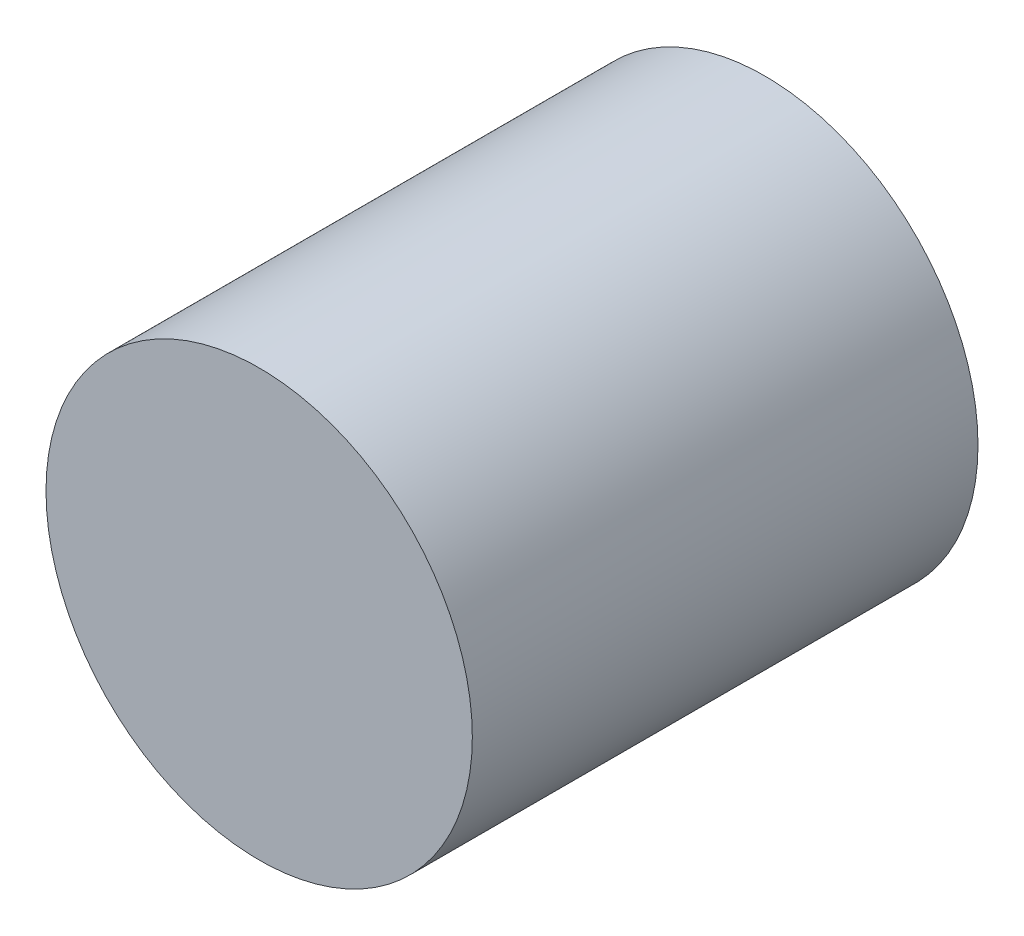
from build123d import *

# Parameters (mm, degrees)
SKETCH1_R           = 21.5
BOSS_EXTRUDE1_DEPTH = 51


with BuildPart() as part:
    # Sketch1 → Boss-Extrude1 (new body)
    with BuildSketch(Plane.XY):
        Circle(SKETCH1_R)
    extrude(amount=BOSS_EXTRUDE1_DEPTH)


solid = part.part
